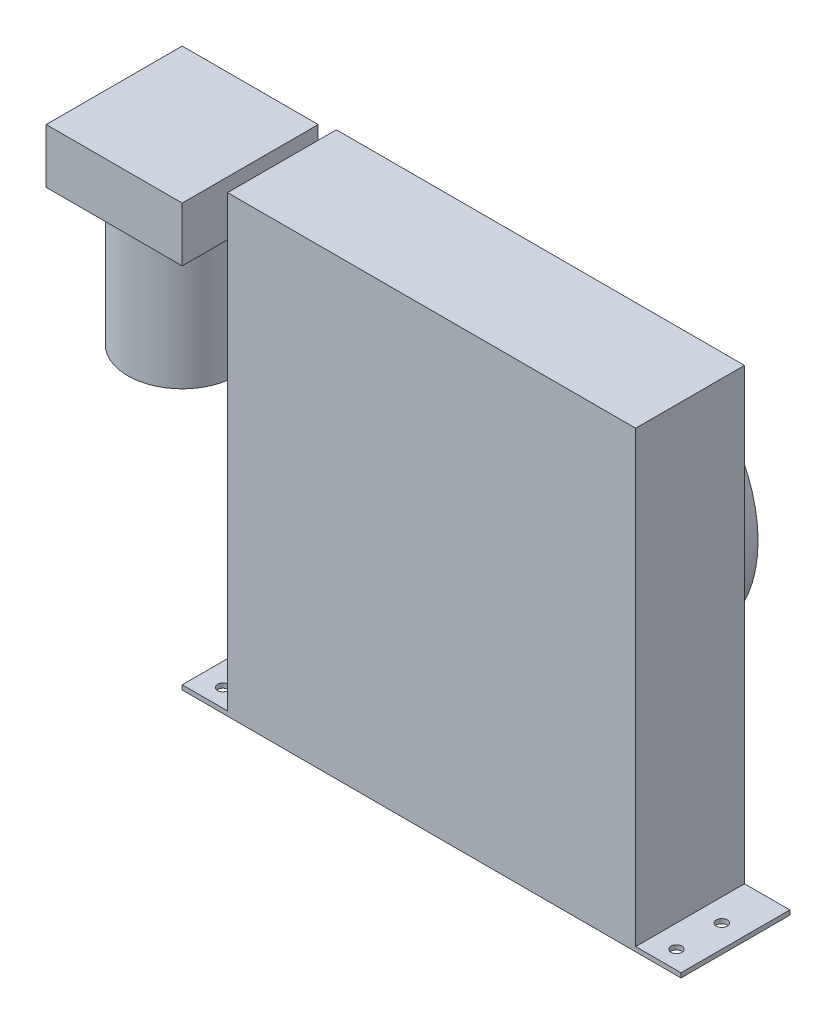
from build123d import *

# Parameters (mm, degrees)
SKETCH_1_W          = 450
SKETCH_1_H          = 500
EXTRUDE_1_DEPTH     = 120
SKETCH_2_R          = 150
EXTRUDE_2_DEPTH     = 90
SKETCH_3_R          = 20
EXTRUDE_3_DEPTH     = 40
SKETCH_4_W          = 150
SKETCH_4_H          = 150
EXTRUDE_4_DEPTH     = 60
SKETCH_5_R          = 60
EXTRUDE_5_DEPTH     = 150
SKETCH_6_W          = 120
SKETCH_6_H          = 5
EXTRUDE_6_DEPTH     = 50
SKETCH_7_R          = 6
CUT_EXTRUDE_1_DEPTH = 50


with BuildPart() as part:
    # Sketch 1 → Extrude 1 (new body)
    with BuildSketch(Plane.XY):
        Rectangle(SKETCH_1_W, SKETCH_1_H)
    extrude(amount=EXTRUDE_1_DEPTH)

    # Sketch 2 → Extrude 2 (add)
    with BuildSketch(Plane(origin=(0, 0, 0), x_dir=(-1, 0, 0), z_dir=(0, 0, -1))):
        with Locations(Location((0, 0, 0), (0, 0, 180))):
            Circle(SKETCH_2_R)
    extrude(amount=EXTRUDE_2_DEPTH)

    # Sketch 3 → Extrude 3 (add)
    with BuildSketch(Plane.ZY.offset(225)):
        with Locations(Location((60, 190, 0), (0, 0, 90))):
            Circle(SKETCH_3_R)
    extrude(amount=EXTRUDE_3_DEPTH)

    # Sketch 4 → Extrude 4 (add)
    with BuildSketch(Plane(origin=(0, 225, 0), x_dir=(-1, 0, 0), z_dir=(0, 1, 0))):
        with Locations((340, 55)):
            Rectangle(SKETCH_4_W, SKETCH_4_H)
    extrude(amount=-EXTRUDE_4_DEPTH)

    # Sketch 5 → Extrude 5 (add)
    with BuildSketch(Plane.XZ.offset(-165)):
        with Locations(Location((-340, 55, 0), (0, 0, 270))):
            Circle(SKETCH_5_R)
    extrude(amount=EXTRUDE_5_DEPTH)

    # Sketch 6 → Extrude 6 (add)
    with BuildSketch(Plane.ZY.offset(225)):
        with Locations((60, -247.5)):
            Rectangle(SKETCH_6_W, SKETCH_6_H)
    extrude_6 = extrude(amount=EXTRUDE_6_DEPTH)

    # Sketch 7 → Cut-Extrude 1 (cut)
    with BuildSketch(Plane.XZ.offset(250)):
        with Locations(Location((-250, 50, 0), (0, 0, 270))):
            Circle(SKETCH_7_R)
        with Locations(Location((-250, 100, 0), (0, 0, 270))):
            Circle(SKETCH_7_R)
    cut_extrude_1 = extrude(amount=-CUT_EXTRUDE_1_DEPTH, mode=Mode.SUBTRACT)

    # Mirror 1: Extrude 6, Cut-Extrude 1 across plane
    add(extrude_6.mirror(Plane(origin=(0, 0, 0), x_dir=(0, 0, 1), z_dir=(1, 0, 0))))
    add(cut_extrude_1.mirror(Plane(origin=(0, 0, 0), x_dir=(0, 0, 1), z_dir=(1, 0, 0))), mode=Mode.SUBTRACT)


solid = part.part
